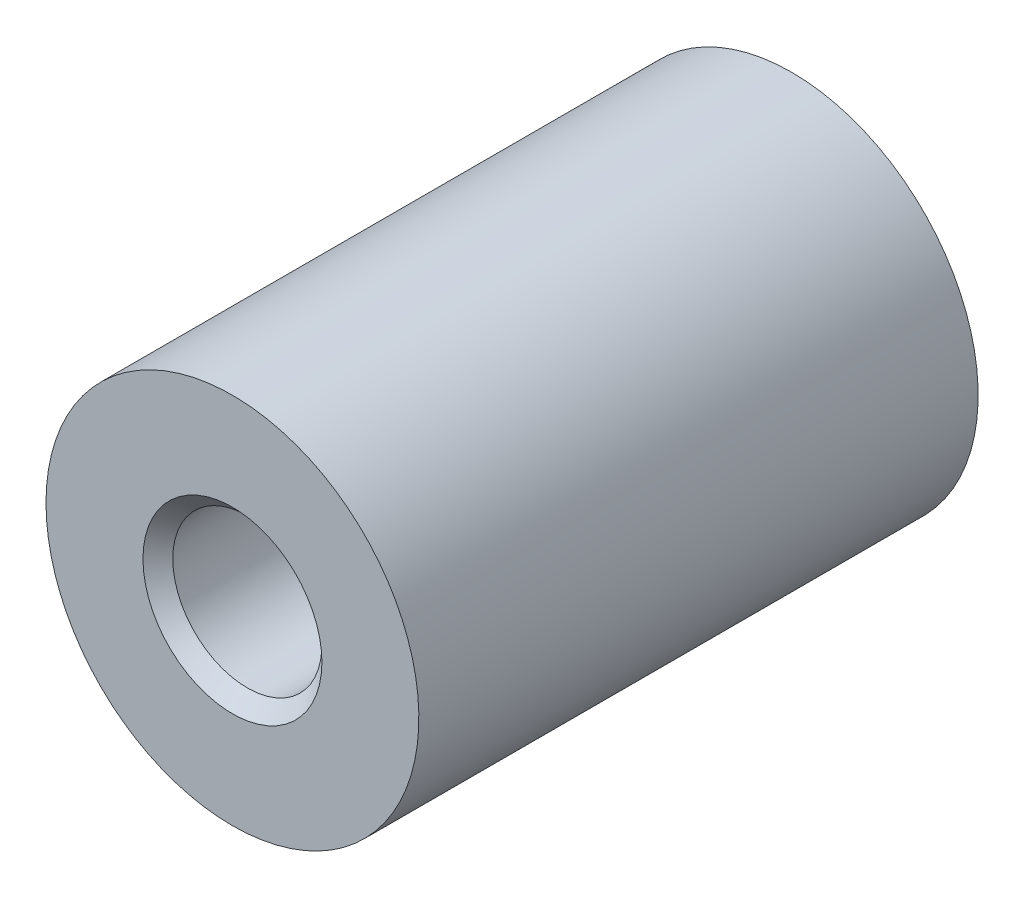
ISO-10303-21;
HEADER;
FILE_DESCRIPTION(('STEP AP214'),'2;1');
FILE_NAME('part.step','',(''),(''),'','','');
FILE_SCHEMA(('AUTOMOTIVE_DESIGN { 1 0 10303 214 1 1 1 1 }'));
ENDSEC;
DATA;
#1=APPLICATION_CONTEXT('core data for automotive mechanical design processes');
#2=APPLICATION_PROTOCOL_DEFINITION('international standard','automotive_design',2000,#1);
#3=PRODUCT_CONTEXT('',#1,'mechanical');
#4=PRODUCT('Part','Part','',(#3));
#5=PRODUCT_RELATED_PRODUCT_CATEGORY('part','',(#4));
#6=PRODUCT_DEFINITION_FORMATION('','',#4);
#7=PRODUCT_DEFINITION_CONTEXT('part definition',#1,'design');
#8=PRODUCT_DEFINITION('design','',#6,#7);
#9=PRODUCT_DEFINITION_SHAPE('','',#8);
#10=(LENGTH_UNIT() NAMED_UNIT(*) SI_UNIT(.MILLI.,.METRE.));
#11=(NAMED_UNIT(*) PLANE_ANGLE_UNIT() SI_UNIT($,.RADIAN.));
#12=(NAMED_UNIT(*) SI_UNIT($,.STERADIAN.) SOLID_ANGLE_UNIT());
#13=UNCERTAINTY_MEASURE_WITH_UNIT(LENGTH_MEASURE(1.E-05),#10,'distance_accuracy_value','');
#14=(GEOMETRIC_REPRESENTATION_CONTEXT(3) GLOBAL_UNCERTAINTY_ASSIGNED_CONTEXT((#13)) GLOBAL_UNIT_ASSIGNED_CONTEXT((#10,
#11,#12)) REPRESENTATION_CONTEXT('',''));
#15=CARTESIAN_POINT('',(0.,0.,0.));
#16=DIRECTION('',(0.,0.,1.));
#17=DIRECTION('',(1.,0.,0.));
#18=AXIS2_PLACEMENT_3D('',#15,#16,#17);
#19=CARTESIAN_POINT('',(0.,0.,0.33333333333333));
#20=DIRECTION('',(0.,0.,1.));
#21=DIRECTION('',(0.,-1.,0.));
#22=AXIS2_PLACEMENT_3D('',#19,#20,#21);
#23=CYLINDRICAL_SURFACE('',#22,5.);
#24=CARTESIAN_POINT('',(0.,0.,0.));
#25=DIRECTION('',(0.,0.,1.));
#26=DIRECTION('',(0.,-1.,0.));
#27=AXIS2_PLACEMENT_3D('',#24,#25,#26);
#28=CIRCLE('',#27,5.);
#29=CARTESIAN_POINT('',(0.,-5.,0.));
#30=VERTEX_POINT('',#29);
#31=EDGE_CURVE('E23',#30,#30,#28,.T.);
#32=ORIENTED_EDGE('',*,*,#31,.T.);
#33=EDGE_LOOP('',(#32));
#34=FACE_BOUND('',#33,.T.);
#35=CARTESIAN_POINT('',(0.,0.,15.));
#36=DIRECTION('',(0.,0.,-1.));
#37=DIRECTION('',(-1.,0.,0.));
#38=AXIS2_PLACEMENT_3D('',#35,#36,#37);
#39=CIRCLE('',#38,5.);
#40=CARTESIAN_POINT('',(-5.,0.,15.));
#41=VERTEX_POINT('',#40);
#42=EDGE_CURVE('E32',#41,#41,#39,.T.);
#43=ORIENTED_EDGE('',*,*,#42,.T.);
#44=EDGE_LOOP('',(#43));
#45=FACE_BOUND('',#44,.T.);
#46=ADVANCED_FACE('F12',(#34,#45),#23,.T.);
#47=CARTESIAN_POINT('',(5.,0.,0.));
#48=DIRECTION('',(0.,0.,-1.));
#49=DIRECTION('',(0.,1.,0.));
#50=AXIS2_PLACEMENT_3D('',#47,#48,#49);
#51=PLANE('',#50);
#52=CARTESIAN_POINT('',(0.,0.,0.));
#53=DIRECTION('',(0.,0.,-1.));
#54=DIRECTION('',(0.,1.,0.));
#55=AXIS2_PLACEMENT_3D('',#52,#53,#54);
#56=CIRCLE('',#55,2.4);
#57=CARTESIAN_POINT('',(0.,2.4,0.));
#58=VERTEX_POINT('',#57);
#59=EDGE_CURVE('E8',#58,#58,#56,.F.);
#60=ORIENTED_EDGE('',*,*,#59,.T.);
#61=EDGE_LOOP('',(#60));
#62=FACE_BOUND('',#61,.T.);
#63=ORIENTED_EDGE('',*,*,#31,.F.);
#64=EDGE_LOOP('',(#63));
#65=FACE_BOUND('',#64,.T.);
#66=ADVANCED_FACE('F58',(#62,#65),#51,.T.);
#67=CARTESIAN_POINT('',(0.,0.,0.));
#68=DIRECTION('',(0.,0.,1.));
#69=DIRECTION('',(0.,-1.,0.));
#70=AXIS2_PLACEMENT_3D('',#67,#68,#69);
#71=CYLINDRICAL_SURFACE('',#70,2.);
#72=CARTESIAN_POINT('',(0.,0.,0.4));
#73=DIRECTION('',(0.,0.,-1.));
#74=DIRECTION('',(0.,1.,0.));
#75=AXIS2_PLACEMENT_3D('',#72,#73,#74);
#76=CIRCLE('',#75,2.);
#77=CARTESIAN_POINT('',(0.,2.,0.4));
#78=VERTEX_POINT('',#77);
#79=EDGE_CURVE('E19',#78,#78,#76,.T.);
#80=ORIENTED_EDGE('',*,*,#79,.T.);
#81=EDGE_LOOP('',(#80));
#82=FACE_BOUND('',#81,.T.);
#83=CARTESIAN_POINT('',(0.,0.,4.));
#84=DIRECTION('',(0.,0.,-1.));
#85=DIRECTION('',(0.,1.,0.));
#86=AXIS2_PLACEMENT_3D('',#83,#84,#85);
#87=CIRCLE('',#86,2.);
#88=CARTESIAN_POINT('',(0.,2.,4.));
#89=VERTEX_POINT('',#88);
#90=EDGE_CURVE('E27',#89,#89,#87,.T.);
#91=ORIENTED_EDGE('',*,*,#90,.F.);
#92=EDGE_LOOP('',(#91));
#93=FACE_BOUND('',#92,.T.);
#94=ADVANCED_FACE('F63',(#82,#93),#71,.F.);
#95=CARTESIAN_POINT('',(0.,0.,4.));
#96=DIRECTION('',(0.,0.,-1.));
#97=DIRECTION('',(0.,1.,0.));
#98=AXIS2_PLACEMENT_3D('',#95,#96,#97);
#99=PLANE('',#98);
#100=ORIENTED_EDGE('',*,*,#90,.T.);
#101=EDGE_LOOP('',(#100));
#102=FACE_BOUND('',#101,.T.);
#103=ADVANCED_FACE('F69',(#102),#99,.T.);
#104=CARTESIAN_POINT('',(0.,0.,0.4));
#105=DIRECTION('',(0.,0.,-1.));
#106=DIRECTION('',(0.,1.,0.));
#107=AXIS2_PLACEMENT_3D('',#104,#105,#106);
#108=CONICAL_SURFACE('',#107,2.,0.785398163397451);
#109=ORIENTED_EDGE('',*,*,#59,.F.);
#110=EDGE_LOOP('',(#109));
#111=FACE_BOUND('',#110,.T.);
#112=ORIENTED_EDGE('',*,*,#79,.F.);
#113=EDGE_LOOP('',(#112));
#114=FACE_BOUND('',#113,.T.);
#115=ADVANCED_FACE('F14',(#111,#114),#108,.F.);
#116=CARTESIAN_POINT('',(0.,5.,15.));
#117=DIRECTION('',(0.,0.,1.));
#118=DIRECTION('',(1.,0.,0.));
#119=AXIS2_PLACEMENT_3D('',#116,#117,#118);
#120=PLANE('',#119);
#121=CARTESIAN_POINT('',(0.,0.,15.));
#122=DIRECTION('',(0.,0.,-1.));
#123=DIRECTION('',(-1.,0.,0.));
#124=AXIS2_PLACEMENT_3D('',#121,#122,#123);
#125=CIRCLE('',#124,2.4);
#126=CARTESIAN_POINT('',(-2.4,0.,15.));
#127=VERTEX_POINT('',#126);
#128=EDGE_CURVE('E35',#127,#127,#125,.T.);
#129=ORIENTED_EDGE('',*,*,#128,.T.);
#130=EDGE_LOOP('',(#129));
#131=FACE_BOUND('',#130,.T.);
#132=ORIENTED_EDGE('',*,*,#42,.F.);
#133=EDGE_LOOP('',(#132));
#134=FACE_BOUND('',#133,.T.);
#135=ADVANCED_FACE('F73',(#131,#134),#120,.T.);
#136=CARTESIAN_POINT('',(0.,0.,15.));
#137=DIRECTION('',(0.,0.,1.));
#138=DIRECTION('',(1.,0.,0.));
#139=AXIS2_PLACEMENT_3D('',#136,#137,#138);
#140=CONICAL_SURFACE('',#139,2.4,0.785398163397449);
#141=CARTESIAN_POINT('',(0.,0.,14.6));
#142=DIRECTION('',(0.,0.,-1.));
#143=DIRECTION('',(-1.,0.,0.));
#144=AXIS2_PLACEMENT_3D('',#141,#142,#143);
#145=CIRCLE('',#144,2.);
#146=CARTESIAN_POINT('',(-2.,0.,14.6));
#147=VERTEX_POINT('',#146);
#148=EDGE_CURVE('E38',#147,#147,#145,.T.);
#149=ORIENTED_EDGE('',*,*,#148,.T.);
#150=EDGE_LOOP('',(#149));
#151=FACE_BOUND('',#150,.T.);
#152=ORIENTED_EDGE('',*,*,#128,.F.);
#153=EDGE_LOOP('',(#152));
#154=FACE_BOUND('',#153,.T.);
#155=ADVANCED_FACE('F55',(#151,#154),#140,.F.);
#156=CARTESIAN_POINT('',(0.,0.,0.));
#157=DIRECTION('',(0.,0.,-1.));
#158=DIRECTION('',(-1.,0.,0.));
#159=AXIS2_PLACEMENT_3D('',#156,#157,#158);
#160=CYLINDRICAL_SURFACE('',#159,2.);
#161=CARTESIAN_POINT('',(0.,0.,11.));
#162=DIRECTION('',(0.,0.,-1.));
#163=DIRECTION('',(-1.,0.,0.));
#164=AXIS2_PLACEMENT_3D('',#161,#162,#163);
#165=CIRCLE('',#164,2.);
#166=CARTESIAN_POINT('',(-2.,0.,11.));
#167=VERTEX_POINT('',#166);
#168=EDGE_CURVE('E41',#167,#167,#165,.T.);
#169=ORIENTED_EDGE('',*,*,#168,.T.);
#170=EDGE_LOOP('',(#169));
#171=FACE_BOUND('',#170,.T.);
#172=ORIENTED_EDGE('',*,*,#148,.F.);
#173=EDGE_LOOP('',(#172));
#174=FACE_BOUND('',#173,.T.);
#175=ADVANCED_FACE('F45',(#171,#174),#160,.F.);
#176=CARTESIAN_POINT('',(0.,2.,11.));
#177=DIRECTION('',(0.,0.,1.));
#178=DIRECTION('',(1.,0.,0.));
#179=AXIS2_PLACEMENT_3D('',#176,#177,#178);
#180=PLANE('',#179);
#181=ORIENTED_EDGE('',*,*,#168,.F.);
#182=EDGE_LOOP('',(#181));
#183=FACE_BOUND('',#182,.T.);
#184=ADVANCED_FACE('F48',(#183),#180,.T.);
#185=CLOSED_SHELL('',(#46,#66,#94,#103,#115,#135,#155,#175,#184));
#186=MANIFOLD_SOLID_BREP('B1',#185);
#187=ADVANCED_BREP_SHAPE_REPRESENTATION('',(#18,#186),#14);
#188=SHAPE_DEFINITION_REPRESENTATION(#9,#187);
ENDSEC;
END-ISO-10303-21;
